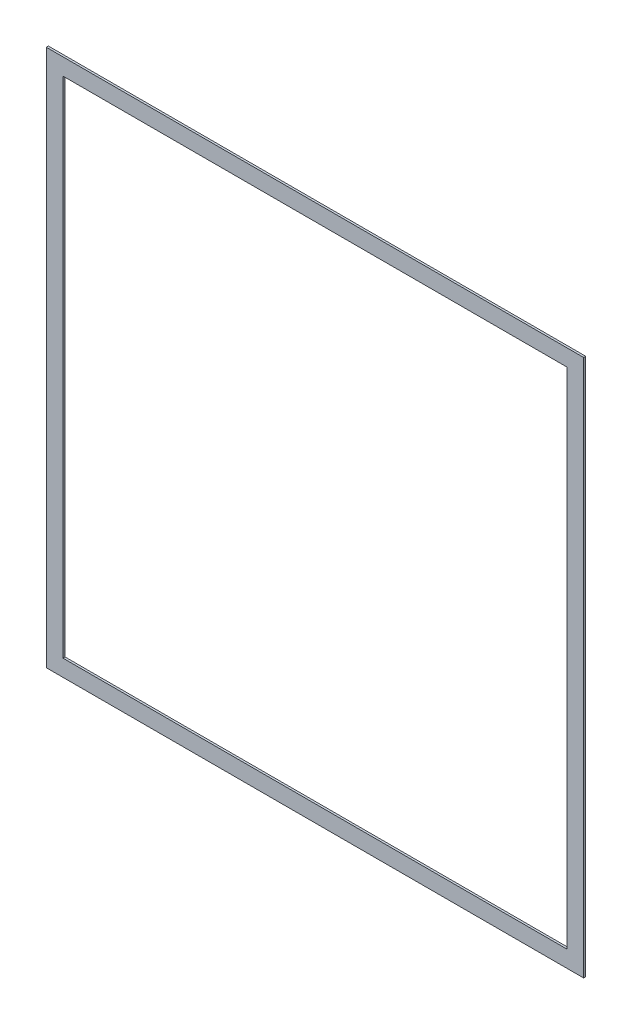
ISO-10303-21;
HEADER;
FILE_DESCRIPTION(('STEP AP214'),'2;1');
FILE_NAME('part.step','',(''),(''),'','','');
FILE_SCHEMA(('AUTOMOTIVE_DESIGN { 1 0 10303 214 1 1 1 1 }'));
ENDSEC;
DATA;
#1=APPLICATION_CONTEXT('core data for automotive mechanical design processes');
#2=APPLICATION_PROTOCOL_DEFINITION('international standard','automotive_design',2000,#1);
#3=PRODUCT_CONTEXT('',#1,'mechanical');
#4=PRODUCT('Part','Part','',(#3));
#5=PRODUCT_RELATED_PRODUCT_CATEGORY('part','',(#4));
#6=PRODUCT_DEFINITION_FORMATION('','',#4);
#7=PRODUCT_DEFINITION_CONTEXT('part definition',#1,'design');
#8=PRODUCT_DEFINITION('design','',#6,#7);
#9=PRODUCT_DEFINITION_SHAPE('','',#8);
#10=(LENGTH_UNIT() NAMED_UNIT(*) SI_UNIT(.MILLI.,.METRE.));
#11=(NAMED_UNIT(*) PLANE_ANGLE_UNIT() SI_UNIT($,.RADIAN.));
#12=(NAMED_UNIT(*) SI_UNIT($,.STERADIAN.) SOLID_ANGLE_UNIT());
#13=UNCERTAINTY_MEASURE_WITH_UNIT(LENGTH_MEASURE(1.E-05),#10,'distance_accuracy_value','');
#14=(GEOMETRIC_REPRESENTATION_CONTEXT(3) GLOBAL_UNCERTAINTY_ASSIGNED_CONTEXT((#13)) GLOBAL_UNIT_ASSIGNED_CONTEXT((#10,
#11,#12)) REPRESENTATION_CONTEXT('',''));
#15=CARTESIAN_POINT('',(0.,0.,0.));
#16=DIRECTION('',(0.,0.,1.));
#17=DIRECTION('',(1.,0.,0.));
#18=AXIS2_PLACEMENT_3D('',#15,#16,#17);
#19=CARTESIAN_POINT('',(409.575,409.575,1.5875));
#20=DIRECTION('',(0.,0.,-1.));
#21=DIRECTION('',(-1.,0.,0.));
#22=AXIS2_PLACEMENT_3D('',#19,#20,#21);
#23=PLANE('',#22);
#24=DIRECTION('',(0.,1.,0.));
#25=VECTOR('',#24,1.);
#26=CARTESIAN_POINT('',(409.575,-409.575,1.5875));
#27=LINE('',#26,#25);
#28=CARTESIAN_POINT('',(409.575,-409.575,1.5875));
#29=VERTEX_POINT('',#28);
#30=CARTESIAN_POINT('',(409.575,409.575,1.5875));
#31=VERTEX_POINT('',#30);
#32=EDGE_CURVE('E135',#29,#31,#27,.T.);
#33=ORIENTED_EDGE('',*,*,#32,.T.);
#34=DIRECTION('',(-1.,0.,0.));
#35=VECTOR('',#34,1.);
#36=CARTESIAN_POINT('',(-409.575,409.575,1.5875));
#37=LINE('',#36,#35);
#38=CARTESIAN_POINT('',(-409.575,409.575,1.5875));
#39=VERTEX_POINT('',#38);
#40=EDGE_CURVE('E138',#31,#39,#37,.T.);
#41=ORIENTED_EDGE('',*,*,#40,.T.);
#42=DIRECTION('',(0.,-1.,0.));
#43=VECTOR('',#42,1.);
#44=CARTESIAN_POINT('',(-409.575,-409.575,1.5875));
#45=LINE('',#44,#43);
#46=CARTESIAN_POINT('',(-409.575,-409.575,1.5875));
#47=VERTEX_POINT('',#46);
#48=EDGE_CURVE('E141',#39,#47,#45,.T.);
#49=ORIENTED_EDGE('',*,*,#48,.T.);
#50=DIRECTION('',(1.,0.,0.));
#51=VECTOR('',#50,1.);
#52=CARTESIAN_POINT('',(-409.575,-409.575,1.5875));
#53=LINE('',#52,#51);
#54=EDGE_CURVE('E143',#47,#29,#53,.T.);
#55=ORIENTED_EDGE('',*,*,#54,.T.);
#56=EDGE_LOOP('',(#33,#41,#49,#55));
#57=FACE_BOUND('',#56,.T.);
#58=DIRECTION('',(0.,-1.,0.));
#59=VECTOR('',#58,1.);
#60=CARTESIAN_POINT('',(-384.175,-384.175,1.5875));
#61=LINE('',#60,#59);
#62=CARTESIAN_POINT('',(-384.175,384.175,1.5875));
#63=VERTEX_POINT('',#62);
#64=CARTESIAN_POINT('',(-384.175,-384.175,1.5875));
#65=VERTEX_POINT('',#64);
#66=EDGE_CURVE('E99',#63,#65,#61,.T.);
#67=ORIENTED_EDGE('',*,*,#66,.F.);
#68=DIRECTION('',(-1.,0.,0.));
#69=VECTOR('',#68,1.);
#70=CARTESIAN_POINT('',(-384.175,384.175,1.5875));
#71=LINE('',#70,#69);
#72=CARTESIAN_POINT('',(384.175,384.175,1.5875));
#73=VERTEX_POINT('',#72);
#74=EDGE_CURVE('E121',#73,#63,#71,.T.);
#75=ORIENTED_EDGE('',*,*,#74,.F.);
#76=DIRECTION('',(0.,1.,0.));
#77=VECTOR('',#76,1.);
#78=CARTESIAN_POINT('',(384.175,-384.175,1.5875));
#79=LINE('',#78,#77);
#80=CARTESIAN_POINT('',(384.175,-384.175,1.5875));
#81=VERTEX_POINT('',#80);
#82=EDGE_CURVE('E119',#81,#73,#79,.T.);
#83=ORIENTED_EDGE('',*,*,#82,.F.);
#84=DIRECTION('',(1.,0.,0.));
#85=VECTOR('',#84,1.);
#86=CARTESIAN_POINT('',(-384.175,-384.175,1.5875));
#87=LINE('',#86,#85);
#88=EDGE_CURVE('E107',#65,#81,#87,.T.);
#89=ORIENTED_EDGE('',*,*,#88,.F.);
#90=EDGE_LOOP('',(#67,#75,#83,#89));
#91=FACE_BOUND('',#90,.T.);
#92=ADVANCED_FACE('F34',(#57,#91),#23,.F.);
#93=CARTESIAN_POINT('',(409.575,409.575,-1.5875));
#94=DIRECTION('',(0.,0.,-1.));
#95=DIRECTION('',(-1.,0.,0.));
#96=AXIS2_PLACEMENT_3D('',#93,#94,#95);
#97=PLANE('',#96);
#98=DIRECTION('',(0.,1.,0.));
#99=VECTOR('',#98,1.);
#100=CARTESIAN_POINT('',(409.575,-409.575,-1.5875));
#101=LINE('',#100,#99);
#102=CARTESIAN_POINT('',(409.575,-409.575,-1.5875));
#103=VERTEX_POINT('',#102);
#104=CARTESIAN_POINT('',(409.575,409.575,-1.5875));
#105=VERTEX_POINT('',#104);
#106=EDGE_CURVE('E115',#103,#105,#101,.T.);
#107=ORIENTED_EDGE('',*,*,#106,.F.);
#108=DIRECTION('',(1.,0.,0.));
#109=VECTOR('',#108,1.);
#110=CARTESIAN_POINT('',(-409.575,-409.575,-1.5875));
#111=LINE('',#110,#109);
#112=CARTESIAN_POINT('',(-409.575,-409.575,-1.5875));
#113=VERTEX_POINT('',#112);
#114=EDGE_CURVE('E139',#113,#103,#111,.T.);
#115=ORIENTED_EDGE('',*,*,#114,.F.);
#116=DIRECTION('',(0.,-1.,0.));
#117=VECTOR('',#116,1.);
#118=CARTESIAN_POINT('',(-409.575,-409.575,-1.5875));
#119=LINE('',#118,#117);
#120=CARTESIAN_POINT('',(-409.575,409.575,-1.5875));
#121=VERTEX_POINT('',#120);
#122=EDGE_CURVE('E150',#121,#113,#119,.T.);
#123=ORIENTED_EDGE('',*,*,#122,.F.);
#124=DIRECTION('',(-1.,0.,0.));
#125=VECTOR('',#124,1.);
#126=CARTESIAN_POINT('',(-409.575,409.575,-1.5875));
#127=LINE('',#126,#125);
#128=EDGE_CURVE('E148',#105,#121,#127,.T.);
#129=ORIENTED_EDGE('',*,*,#128,.F.);
#130=EDGE_LOOP('',(#107,#115,#123,#129));
#131=FACE_BOUND('',#130,.T.);
#132=DIRECTION('',(-1.,0.,0.));
#133=VECTOR('',#132,1.);
#134=CARTESIAN_POINT('',(-384.175,384.175,-1.5875));
#135=LINE('',#134,#133);
#136=CARTESIAN_POINT('',(384.175,384.175,-1.5875));
#137=VERTEX_POINT('',#136);
#138=CARTESIAN_POINT('',(-384.175,384.175,-1.5875));
#139=VERTEX_POINT('',#138);
#140=EDGE_CURVE('E108',#137,#139,#135,.T.);
#141=ORIENTED_EDGE('',*,*,#140,.T.);
#142=DIRECTION('',(0.,-1.,0.));
#143=VECTOR('',#142,1.);
#144=CARTESIAN_POINT('',(-384.175,-384.175,-1.5875));
#145=LINE('',#144,#143);
#146=CARTESIAN_POINT('',(-384.175,-384.175,-1.5875));
#147=VERTEX_POINT('',#146);
#148=EDGE_CURVE('E57',#139,#147,#145,.T.);
#149=ORIENTED_EDGE('',*,*,#148,.T.);
#150=DIRECTION('',(1.,0.,0.));
#151=VECTOR('',#150,1.);
#152=CARTESIAN_POINT('',(-384.175,-384.175,-1.5875));
#153=LINE('',#152,#151);
#154=CARTESIAN_POINT('',(384.175,-384.175,-1.5875));
#155=VERTEX_POINT('',#154);
#156=EDGE_CURVE('E114',#147,#155,#153,.T.);
#157=ORIENTED_EDGE('',*,*,#156,.T.);
#158=DIRECTION('',(0.,1.,0.));
#159=VECTOR('',#158,1.);
#160=CARTESIAN_POINT('',(384.175,-384.175,-1.5875));
#161=LINE('',#160,#159);
#162=EDGE_CURVE('E127',#155,#137,#161,.T.);
#163=ORIENTED_EDGE('',*,*,#162,.T.);
#164=EDGE_LOOP('',(#141,#149,#157,#163));
#165=FACE_BOUND('',#164,.T.);
#166=ADVANCED_FACE('F168',(#131,#165),#97,.T.);
#167=CARTESIAN_POINT('',(409.575,-409.575,1.5875));
#168=DIRECTION('',(-1.,0.,0.));
#169=DIRECTION('',(0.,0.,1.));
#170=AXIS2_PLACEMENT_3D('',#167,#168,#169);
#171=PLANE('',#170);
#172=ORIENTED_EDGE('',*,*,#106,.T.);
#173=DIRECTION('',(0.,0.,-1.));
#174=VECTOR('',#173,1.);
#175=CARTESIAN_POINT('',(409.575,409.575,1.5875));
#176=LINE('',#175,#174);
#177=EDGE_CURVE('E11',#31,#105,#176,.T.);
#178=ORIENTED_EDGE('',*,*,#177,.F.);
#179=ORIENTED_EDGE('',*,*,#32,.F.);
#180=DIRECTION('',(0.,0.,-1.));
#181=VECTOR('',#180,1.);
#182=CARTESIAN_POINT('',(409.575,-409.575,1.5875));
#183=LINE('',#182,#181);
#184=EDGE_CURVE('E145',#29,#103,#183,.T.);
#185=ORIENTED_EDGE('',*,*,#184,.T.);
#186=EDGE_LOOP('',(#172,#178,#179,#185));
#187=FACE_BOUND('',#186,.T.);
#188=ADVANCED_FACE('F36',(#187),#171,.F.);
#189=CARTESIAN_POINT('',(-409.575,409.575,1.5875));
#190=DIRECTION('',(0.,-1.,0.));
#191=DIRECTION('',(0.,0.,-1.));
#192=AXIS2_PLACEMENT_3D('',#189,#190,#191);
#193=PLANE('',#192);
#194=ORIENTED_EDGE('',*,*,#128,.T.);
#195=DIRECTION('',(0.,0.,-1.));
#196=VECTOR('',#195,1.);
#197=CARTESIAN_POINT('',(-409.575,409.575,1.5875));
#198=LINE('',#197,#196);
#199=EDGE_CURVE('E42',#39,#121,#198,.T.);
#200=ORIENTED_EDGE('',*,*,#199,.F.);
#201=ORIENTED_EDGE('',*,*,#40,.F.);
#202=ORIENTED_EDGE('',*,*,#177,.T.);
#203=EDGE_LOOP('',(#194,#200,#201,#202));
#204=FACE_BOUND('',#203,.T.);
#205=ADVANCED_FACE('F178',(#204),#193,.F.);
#206=CARTESIAN_POINT('',(-409.575,-409.575,1.5875));
#207=DIRECTION('',(1.,0.,0.));
#208=DIRECTION('',(0.,0.,-1.));
#209=AXIS2_PLACEMENT_3D('',#206,#207,#208);
#210=PLANE('',#209);
#211=ORIENTED_EDGE('',*,*,#122,.T.);
#212=DIRECTION('',(0.,0.,-1.));
#213=VECTOR('',#212,1.);
#214=CARTESIAN_POINT('',(-409.575,-409.575,1.5875));
#215=LINE('',#214,#213);
#216=EDGE_CURVE('E155',#47,#113,#215,.T.);
#217=ORIENTED_EDGE('',*,*,#216,.F.);
#218=ORIENTED_EDGE('',*,*,#48,.F.);
#219=ORIENTED_EDGE('',*,*,#199,.T.);
#220=EDGE_LOOP('',(#211,#217,#218,#219));
#221=FACE_BOUND('',#220,.T.);
#222=ADVANCED_FACE('F162',(#221),#210,.F.);
#223=CARTESIAN_POINT('',(-409.575,-409.575,1.5875));
#224=DIRECTION('',(0.,1.,0.));
#225=DIRECTION('',(0.,0.,1.));
#226=AXIS2_PLACEMENT_3D('',#223,#224,#225);
#227=PLANE('',#226);
#228=ORIENTED_EDGE('',*,*,#114,.T.);
#229=ORIENTED_EDGE('',*,*,#184,.F.);
#230=ORIENTED_EDGE('',*,*,#54,.F.);
#231=ORIENTED_EDGE('',*,*,#216,.T.);
#232=EDGE_LOOP('',(#228,#229,#230,#231));
#233=FACE_BOUND('',#232,.T.);
#234=ADVANCED_FACE('F172',(#233),#227,.F.);
#235=CARTESIAN_POINT('',(-384.175,-384.175,1.5875));
#236=DIRECTION('',(1.,0.,0.));
#237=DIRECTION('',(0.,0.,-1.));
#238=AXIS2_PLACEMENT_3D('',#235,#236,#237);
#239=PLANE('',#238);
#240=ORIENTED_EDGE('',*,*,#148,.F.);
#241=DIRECTION('',(0.,0.,-1.));
#242=VECTOR('',#241,1.);
#243=CARTESIAN_POINT('',(-384.175,384.175,1.5875));
#244=LINE('',#243,#242);
#245=EDGE_CURVE('E103',#63,#139,#244,.T.);
#246=ORIENTED_EDGE('',*,*,#245,.F.);
#247=ORIENTED_EDGE('',*,*,#66,.T.);
#248=DIRECTION('',(0.,0.,-1.));
#249=VECTOR('',#248,1.);
#250=CARTESIAN_POINT('',(-384.175,-384.175,1.5875));
#251=LINE('',#250,#249);
#252=EDGE_CURVE('E102',#65,#147,#251,.T.);
#253=ORIENTED_EDGE('',*,*,#252,.T.);
#254=EDGE_LOOP('',(#240,#246,#247,#253));
#255=FACE_BOUND('',#254,.T.);
#256=ADVANCED_FACE('F101',(#255),#239,.T.);
#257=CARTESIAN_POINT('',(-384.175,-384.175,1.5875));
#258=DIRECTION('',(0.,1.,0.));
#259=DIRECTION('',(0.,0.,1.));
#260=AXIS2_PLACEMENT_3D('',#257,#258,#259);
#261=PLANE('',#260);
#262=ORIENTED_EDGE('',*,*,#156,.F.);
#263=ORIENTED_EDGE('',*,*,#252,.F.);
#264=ORIENTED_EDGE('',*,*,#88,.T.);
#265=DIRECTION('',(0.,0.,-1.));
#266=VECTOR('',#265,1.);
#267=CARTESIAN_POINT('',(384.175,-384.175,1.5875));
#268=LINE('',#267,#266);
#269=EDGE_CURVE('E116',#81,#155,#268,.T.);
#270=ORIENTED_EDGE('',*,*,#269,.T.);
#271=EDGE_LOOP('',(#262,#263,#264,#270));
#272=FACE_BOUND('',#271,.T.);
#273=ADVANCED_FACE('F111',(#272),#261,.T.);
#274=CARTESIAN_POINT('',(384.175,-384.175,1.5875));
#275=DIRECTION('',(-1.,0.,0.));
#276=DIRECTION('',(0.,0.,1.));
#277=AXIS2_PLACEMENT_3D('',#274,#275,#276);
#278=PLANE('',#277);
#279=ORIENTED_EDGE('',*,*,#162,.F.);
#280=ORIENTED_EDGE('',*,*,#269,.F.);
#281=ORIENTED_EDGE('',*,*,#82,.T.);
#282=DIRECTION('',(0.,0.,-1.));
#283=VECTOR('',#282,1.);
#284=CARTESIAN_POINT('',(384.175,384.175,1.5875));
#285=LINE('',#284,#283);
#286=EDGE_CURVE('E49',#73,#137,#285,.T.);
#287=ORIENTED_EDGE('',*,*,#286,.T.);
#288=EDGE_LOOP('',(#279,#280,#281,#287));
#289=FACE_BOUND('',#288,.T.);
#290=ADVANCED_FACE('F200',(#289),#278,.T.);
#291=CARTESIAN_POINT('',(-384.175,384.175,1.5875));
#292=DIRECTION('',(0.,-1.,0.));
#293=DIRECTION('',(0.,0.,-1.));
#294=AXIS2_PLACEMENT_3D('',#291,#292,#293);
#295=PLANE('',#294);
#296=ORIENTED_EDGE('',*,*,#140,.F.);
#297=ORIENTED_EDGE('',*,*,#286,.F.);
#298=ORIENTED_EDGE('',*,*,#74,.T.);
#299=ORIENTED_EDGE('',*,*,#245,.T.);
#300=EDGE_LOOP('',(#296,#297,#298,#299));
#301=FACE_BOUND('',#300,.T.);
#302=ADVANCED_FACE('F204',(#301),#295,.T.);
#303=CLOSED_SHELL('',(#92,#166,#188,#205,#222,#234,#256,#273,#290,#302));
#304=MANIFOLD_SOLID_BREP('B2',#303);
#305=ADVANCED_BREP_SHAPE_REPRESENTATION('',(#18,#304),#14);
#306=SHAPE_DEFINITION_REPRESENTATION(#9,#305);
ENDSEC;
END-ISO-10303-21;
